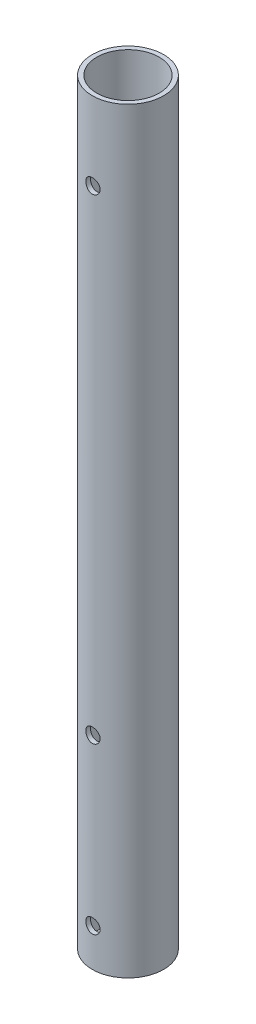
from build123d import *

# Parameters (mm, degrees)
SKETCH_1_R               = 8
SKETCH_1_R_2             = 7
EXTRUDE_1_DEPTH          = 169.65
CUT_EXTRUDE_1_DEPTH      = 171.026828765
CUT_EXTRUDE_1_DEPTH_BACK = 171.026828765
SKETCH_3_R               = 1.6


with BuildPart() as part:
    # Sketch 1 → Extrude 1 (new body)
    with BuildSketch(Plane(origin=(0, 0, 0), x_dir=(1, 0, 0), z_dir=(0, 1, 0))):
        with Locations(Location((0, 0, 0), (0, 0, 90))):
            Circle(SKETCH_1_R)
        with Locations(Location((0, 0, 0), (0, 0, 90))):
            Circle(SKETCH_1_R_2, mode=Mode.SUBTRACT)
    extrude(amount=EXTRUDE_1_DEPTH)

    # Sketch 3 → Cut-Extrude 1 (cut, two sides: drawn at the far end of the back side and taken through both)
    with BuildSketch(Plane.XY.offset(-CUT_EXTRUDE_1_DEPTH_BACK)):
        with Locations((0, 152.15)):
            Circle(SKETCH_3_R)
        with Locations((0, 45.5)):
            Circle(SKETCH_3_R)
        with Locations((0, 8.5)):
            Circle(SKETCH_3_R)
    extrude(amount=CUT_EXTRUDE_1_DEPTH + CUT_EXTRUDE_1_DEPTH_BACK, mode=Mode.SUBTRACT)


solid = part.part
